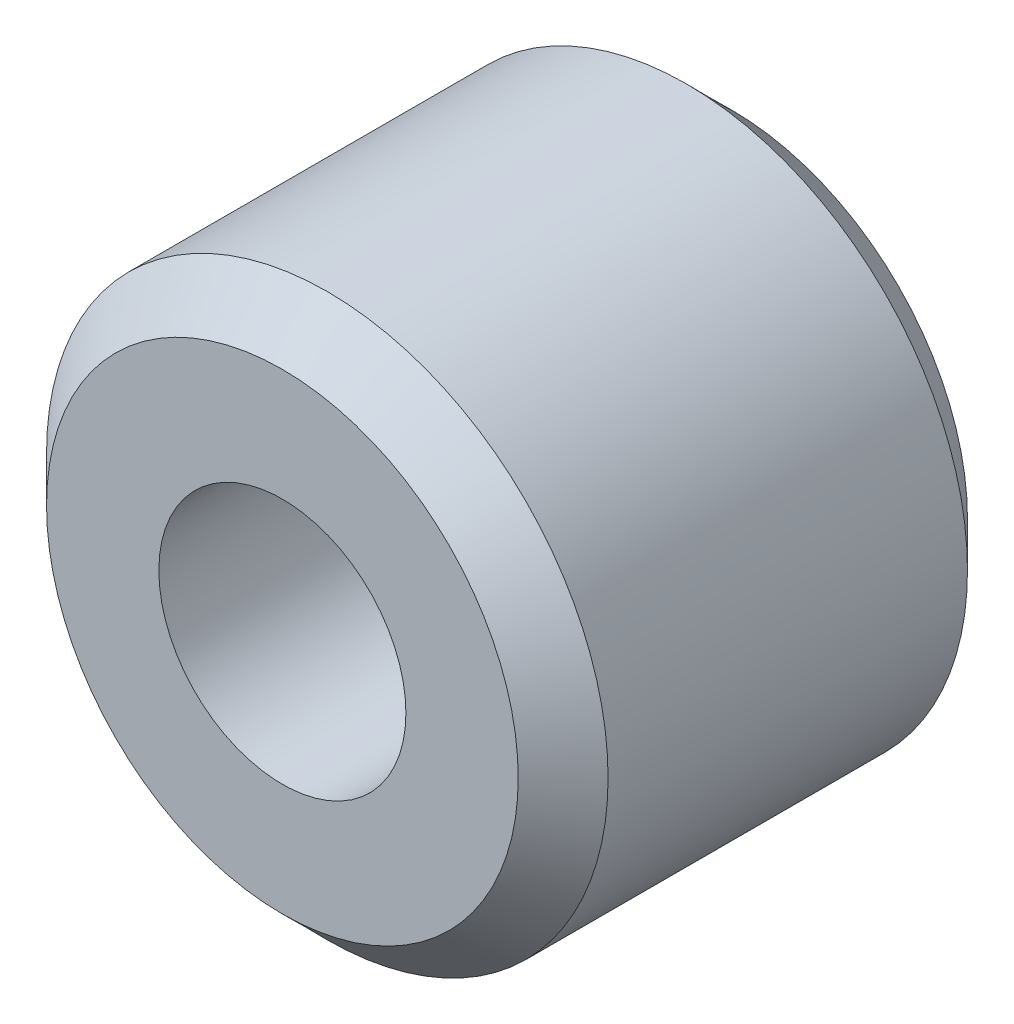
ISO-10303-21;
HEADER;
FILE_DESCRIPTION(('STEP AP214'),'2;1');
FILE_NAME('part.step','',(''),(''),'','','');
FILE_SCHEMA(('AUTOMOTIVE_DESIGN { 1 0 10303 214 1 1 1 1 }'));
ENDSEC;
DATA;
#1=APPLICATION_CONTEXT('core data for automotive mechanical design processes');
#2=APPLICATION_PROTOCOL_DEFINITION('international standard','automotive_design',2000,#1);
#3=PRODUCT_CONTEXT('',#1,'mechanical');
#4=PRODUCT('Part','Part','',(#3));
#5=PRODUCT_RELATED_PRODUCT_CATEGORY('part','',(#4));
#6=PRODUCT_DEFINITION_FORMATION('','',#4);
#7=PRODUCT_DEFINITION_CONTEXT('part definition',#1,'design');
#8=PRODUCT_DEFINITION('design','',#6,#7);
#9=PRODUCT_DEFINITION_SHAPE('','',#8);
#10=(LENGTH_UNIT() NAMED_UNIT(*) SI_UNIT(.MILLI.,.METRE.));
#11=(NAMED_UNIT(*) PLANE_ANGLE_UNIT() SI_UNIT($,.RADIAN.));
#12=(NAMED_UNIT(*) SI_UNIT($,.STERADIAN.) SOLID_ANGLE_UNIT());
#13=UNCERTAINTY_MEASURE_WITH_UNIT(LENGTH_MEASURE(1.E-05),#10,'distance_accuracy_value','');
#14=(GEOMETRIC_REPRESENTATION_CONTEXT(3) GLOBAL_UNCERTAINTY_ASSIGNED_CONTEXT((#13)) GLOBAL_UNIT_ASSIGNED_CONTEXT((#10,
#11,#12)) REPRESENTATION_CONTEXT('',''));
#15=CARTESIAN_POINT('',(0.,0.,0.));
#16=DIRECTION('',(0.,0.,1.));
#17=DIRECTION('',(1.,0.,0.));
#18=AXIS2_PLACEMENT_3D('',#15,#16,#17);
#19=CARTESIAN_POINT('',(0.,0.,20.));
#20=DIRECTION('',(0.,0.,-1.));
#21=DIRECTION('',(-1.,0.,0.));
#22=AXIS2_PLACEMENT_3D('',#19,#20,#21);
#23=CYLINDRICAL_SURFACE('',#22,12.5);
#24=CARTESIAN_POINT('',(0.,0.,2.));
#25=DIRECTION('',(0.,0.,1.));
#26=DIRECTION('',(1.,0.,0.));
#27=AXIS2_PLACEMENT_3D('',#24,#25,#26);
#28=CIRCLE('',#27,12.5);
#29=CARTESIAN_POINT('',(12.5,0.,2.));
#30=VERTEX_POINT('',#29);
#31=EDGE_CURVE('E43',#30,#30,#28,.T.);
#32=ORIENTED_EDGE('',*,*,#31,.T.);
#33=EDGE_LOOP('',(#32));
#34=FACE_BOUND('',#33,.T.);
#35=CARTESIAN_POINT('',(0.,0.,18.));
#36=DIRECTION('',(0.,0.,1.));
#37=DIRECTION('',(1.,0.,0.));
#38=AXIS2_PLACEMENT_3D('',#35,#36,#37);
#39=CIRCLE('',#38,12.5);
#40=CARTESIAN_POINT('',(12.5,0.,18.));
#41=VERTEX_POINT('',#40);
#42=EDGE_CURVE('E47',#41,#41,#39,.F.);
#43=ORIENTED_EDGE('',*,*,#42,.T.);
#44=EDGE_LOOP('',(#43));
#45=FACE_BOUND('',#44,.T.);
#46=ADVANCED_FACE('F32',(#34,#45),#23,.T.);
#47=CARTESIAN_POINT('',(0.,0.,20.));
#48=DIRECTION('',(0.,0.,1.));
#49=DIRECTION('',(1.,0.,0.));
#50=AXIS2_PLACEMENT_3D('',#47,#48,#49);
#51=PLANE('',#50);
#52=CARTESIAN_POINT('',(0.,0.,20.));
#53=DIRECTION('',(0.,0.,1.));
#54=DIRECTION('',(1.,0.,0.));
#55=AXIS2_PLACEMENT_3D('',#52,#53,#54);
#56=CIRCLE('',#55,5.5);
#57=CARTESIAN_POINT('',(5.5,0.,20.));
#58=VERTEX_POINT('',#57);
#59=EDGE_CURVE('E55',#58,#58,#56,.T.);
#60=ORIENTED_EDGE('',*,*,#59,.F.);
#61=EDGE_LOOP('',(#60));
#62=FACE_BOUND('',#61,.T.);
#63=CARTESIAN_POINT('',(0.,0.,20.));
#64=DIRECTION('',(0.,0.,1.));
#65=DIRECTION('',(1.,0.,0.));
#66=AXIS2_PLACEMENT_3D('',#63,#64,#65);
#67=CIRCLE('',#66,10.5);
#68=CARTESIAN_POINT('',(10.5,0.,20.));
#69=VERTEX_POINT('',#68);
#70=EDGE_CURVE('E10',#69,#69,#67,.T.);
#71=ORIENTED_EDGE('',*,*,#70,.T.);
#72=EDGE_LOOP('',(#71));
#73=FACE_BOUND('',#72,.T.);
#74=ADVANCED_FACE('F61',(#62,#73),#51,.T.);
#75=CARTESIAN_POINT('',(0.,0.,0.));
#76=DIRECTION('',(0.,0.,1.));
#77=DIRECTION('',(1.,0.,0.));
#78=AXIS2_PLACEMENT_3D('',#75,#76,#77);
#79=PLANE('',#78);
#80=CARTESIAN_POINT('',(0.,0.,0.));
#81=DIRECTION('',(0.,0.,1.));
#82=DIRECTION('',(1.,0.,0.));
#83=AXIS2_PLACEMENT_3D('',#80,#81,#82);
#84=CIRCLE('',#83,5.5);
#85=CARTESIAN_POINT('',(5.5,0.,0.));
#86=VERTEX_POINT('',#85);
#87=EDGE_CURVE('E52',#86,#86,#84,.F.);
#88=ORIENTED_EDGE('',*,*,#87,.F.);
#89=EDGE_LOOP('',(#88));
#90=FACE_BOUND('',#89,.T.);
#91=CARTESIAN_POINT('',(0.,0.,0.));
#92=DIRECTION('',(0.,0.,1.));
#93=DIRECTION('',(1.,0.,0.));
#94=AXIS2_PLACEMENT_3D('',#91,#92,#93);
#95=CIRCLE('',#94,10.5);
#96=CARTESIAN_POINT('',(10.5,0.,0.));
#97=VERTEX_POINT('',#96);
#98=EDGE_CURVE('E39',#97,#97,#95,.F.);
#99=ORIENTED_EDGE('',*,*,#98,.T.);
#100=EDGE_LOOP('',(#99));
#101=FACE_BOUND('',#100,.T.);
#102=ADVANCED_FACE('F63',(#90,#101),#79,.F.);
#103=CARTESIAN_POINT('',(0.,0.,2.));
#104=DIRECTION('',(0.,0.,1.));
#105=DIRECTION('',(1.,0.,0.));
#106=AXIS2_PLACEMENT_3D('',#103,#104,#105);
#107=CONICAL_SURFACE('',#106,12.5,0.78539816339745);
#108=ORIENTED_EDGE('',*,*,#98,.F.);
#109=EDGE_LOOP('',(#108));
#110=FACE_BOUND('',#109,.T.);
#111=ORIENTED_EDGE('',*,*,#31,.F.);
#112=EDGE_LOOP('',(#111));
#113=FACE_BOUND('',#112,.T.);
#114=ADVANCED_FACE('F69',(#110,#113),#107,.T.);
#115=CARTESIAN_POINT('',(0.,0.,20.));
#116=DIRECTION('',(0.,0.,-1.));
#117=DIRECTION('',(-1.,0.,0.));
#118=AXIS2_PLACEMENT_3D('',#115,#116,#117);
#119=CONICAL_SURFACE('',#118,10.5,0.785398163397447);
#120=ORIENTED_EDGE('',*,*,#42,.F.);
#121=EDGE_LOOP('',(#120));
#122=FACE_BOUND('',#121,.T.);
#123=ORIENTED_EDGE('',*,*,#70,.F.);
#124=EDGE_LOOP('',(#123));
#125=FACE_BOUND('',#124,.T.);
#126=ADVANCED_FACE('F34',(#122,#125),#119,.T.);
#127=CARTESIAN_POINT('',(0.,0.,-15.556349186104));
#128=DIRECTION('',(0.,0.,1.));
#129=DIRECTION('',(1.,0.,0.));
#130=AXIS2_PLACEMENT_3D('',#127,#128,#129);
#131=CYLINDRICAL_SURFACE('',#130,5.5);
#132=ORIENTED_EDGE('',*,*,#87,.T.);
#133=EDGE_LOOP('',(#132));
#134=FACE_BOUND('',#133,.T.);
#135=ORIENTED_EDGE('',*,*,#59,.T.);
#136=EDGE_LOOP('',(#135));
#137=FACE_BOUND('',#136,.T.);
#138=ADVANCED_FACE('F59',(#134,#137),#131,.F.);
#139=CLOSED_SHELL('',(#46,#74,#102,#114,#126,#138));
#140=MANIFOLD_SOLID_BREP('B2',#139);
#141=ADVANCED_BREP_SHAPE_REPRESENTATION('',(#18,#140),#14);
#142=SHAPE_DEFINITION_REPRESENTATION(#9,#141);
ENDSEC;
END-ISO-10303-21;
